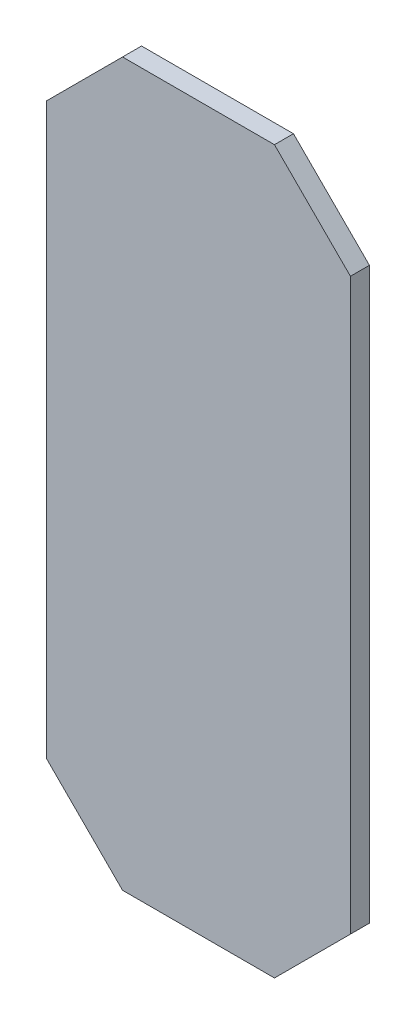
from build123d import *

# Parameters (mm, degrees)
SKICA1_W       = 80
SKICA1_H       = 190
EXTRUDE1_DEPTH = 5
ZKOSIT1_SIZE   = 20


with BuildPart() as part:
    # Skica1 → Extrude1 (new body)
    with BuildSketch(Plane.XY):
        Rectangle(SKICA1_W, SKICA1_H)
    extrude(amount=EXTRUDE1_DEPTH)

    # Zkosit1
    zkosit1_edges = [part.edges().sort_by_distance(p)[0] for p in [
        (-40, 95, 2.5),
        (40, 95, 2.5),
        (40, -95, 2.5),
        (-40, -95, 2.5),
    ]]
    chamfer(zkosit1_edges, length=ZKOSIT1_SIZE)


solid = part.part
